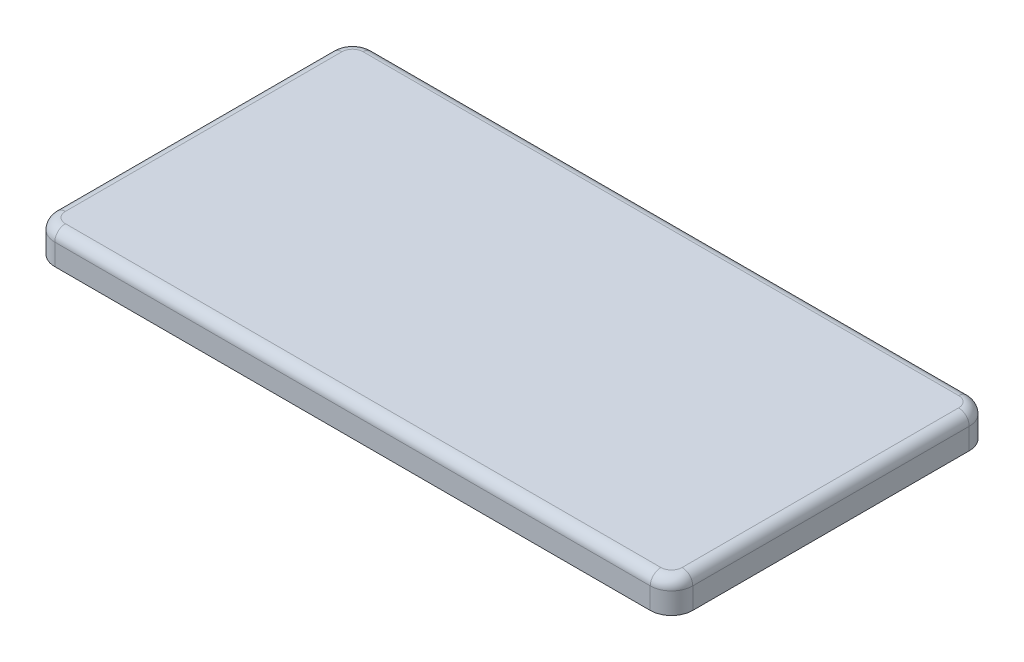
from build123d import *

# Parameters (mm, degrees)
EXTRUDE_1_DEPTH           = 1.5
FILLET_1_R                = 1
CUT_EXTRUDE_2_DEPTH       = 1
SKETCH_4_W                = 3.3
SKETCH_4_H                = 4.9
EXTRUDE_4_DEPTH           = 8
EXTRUDE_4_DRAFT           = 0.6
EXTRUDE_4_PROFILE_2_DEPTH = 8
EXTRUDE_4_PROFILE_2_DRAFT = 0.6
FILLET_2_R                = 0.8


with BuildPart() as part:
    # Sketch 1 → Extrude 1 (new, symmetric)
    with BuildSketch(Plane(origin=(0, 0, 0), x_dir=(0, 0, -1), z_dir=(0, 1, 0))):
        with BuildLine():
            Line((-13, 30), (13, 30))
            ThreePointArc((13, 30), (14.414213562, 29.414213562), (15, 28))
            Line((15, 28), (15, -28))
            ThreePointArc((15, -28), (14.414213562, -29.414213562), (13, -30))
            Line((13, -30), (-13, -30))
            ThreePointArc((-13, -30), (-14.414213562, -29.414213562), (-15, -28))
            Line((-15, -28), (-15, 28))
            ThreePointArc((-15, 28), (-14.414213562, 29.414213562), (-13, 30))
        make_face()
    extrude(amount=EXTRUDE_1_DEPTH, both=True)

    # Fillet 1
    fillet_1_edges = [part.edges().sort_by_distance(p)[0] for p in [
        (-29.414213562, 1.5, 14.414213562),
        (0, 1.5, 15),
        (29.414213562, 1.5, 14.414213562),
        (30, 1.5, 0),
        (29.414213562, 1.5, -14.414213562),
        (0, 1.5, -15),
        (-29.414213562, 1.5, -14.414213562),
        (-30, 1.5, 0),
    ]]
    fillet(fillet_1_edges, radius=FILLET_1_R)

    # Sketch 2 → Cut-Extrude 2 (cut)
    with BuildSketch(Plane.XZ.offset(1.5)):
        with BuildLine():
            Line((-28, 13.2), (28, 13.2))
            ThreePointArc((28, 13.2), (28.141421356, 13.141421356), (28.2, 13))
            Line((28.2, 13), (28.2, -13))
            ThreePointArc((28.2, -13), (28.141421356, -13.141421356), (28, -13.2))
            Line((28, -13.2), (-28, -13.2))
            ThreePointArc((-28, -13.2), (-28.141421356, -13.141421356), (-28.2, -13))
            Line((-28.2, -13), (-28.2, 13))
            ThreePointArc((-28.2, 13), (-28.141421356, 13.141421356), (-28, 13.2))
        make_face()
    extrude(amount=-CUT_EXTRUDE_2_DEPTH, mode=Mode.SUBTRACT)


with BuildPart() as extrude_4_tool:
    # Sketch 4 → Extrude 4 (with draft: the straight prism first)
    with BuildSketch(Plane.XZ.offset(0.5)):
        with Locations((-15, 0)):
            Rectangle(SKETCH_4_W, SKETCH_4_H)
    extrude(amount=EXTRUDE_4_DEPTH)
    # Extrude 4: the draft: its side faces are tilted about the plane it starts from
    extrude_4_sides = [extrude_4_tool.faces().sort_by_distance(p)[0] for p in [
        (-16.65, -4.5, 0),
        (-15, -4.5, -2.45),
        (-13.35, -4.5, 0),
        (-15, -4.5, 2.45),
    ]]
    draft(extrude_4_sides, Plane.XZ.offset(0.5), EXTRUDE_4_DRAFT)


with BuildPart() as part_1:
    add(part.part)

    # Extrude 4: add extrude_4_tool
    add(extrude_4_tool.part)


with BuildPart() as extrude_4_profile_2_tool:
    # Sketch 4 → Extrude 4 profile 2 (with draft: the straight prism first)
    with BuildSketch(Plane.XZ.offset(0.5)):
        with Locations((15, 0)):
            Rectangle(SKETCH_4_W, SKETCH_4_H)
    extrude(amount=EXTRUDE_4_PROFILE_2_DEPTH)
    # Extrude 4 profile 2: the draft: its side faces are tilted about the plane it starts from
    extrude_4_profile_2_sides = [extrude_4_profile_2_tool.faces().sort_by_distance(p)[0] for p in [
        (15, -4.5, -2.45),
        (16.65, -4.5, 0),
        (15, -4.5, 2.45),
        (13.35, -4.5, 0),
    ]]
    draft(extrude_4_profile_2_sides, Plane.XZ.offset(0.5), EXTRUDE_4_PROFILE_2_DRAFT)


with BuildPart() as part_2:
    add(part_1.part)

    # Extrude 4 profile 2: add extrude_4_profile_2_tool
    add(extrude_4_profile_2_tool.part)

    # Fillet 2
    fillet_2_edges = [part_2.edges().sort_by_distance(p)[0] for p in [
        (-16.566221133, -8.5, 0),
        (-15, -8.5, -2.366221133),
        (-13.433778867, -8.5, 0),
        (-15, -8.5, 2.366221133),
        (13.433778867, -8.5, 0),
        (15, -8.5, -2.366221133),
        (16.566221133, -8.5, 0),
        (15, -8.5, 2.366221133),
    ]]
    fillet(fillet_2_edges, radius=FILLET_2_R)


solid = part_2.part
